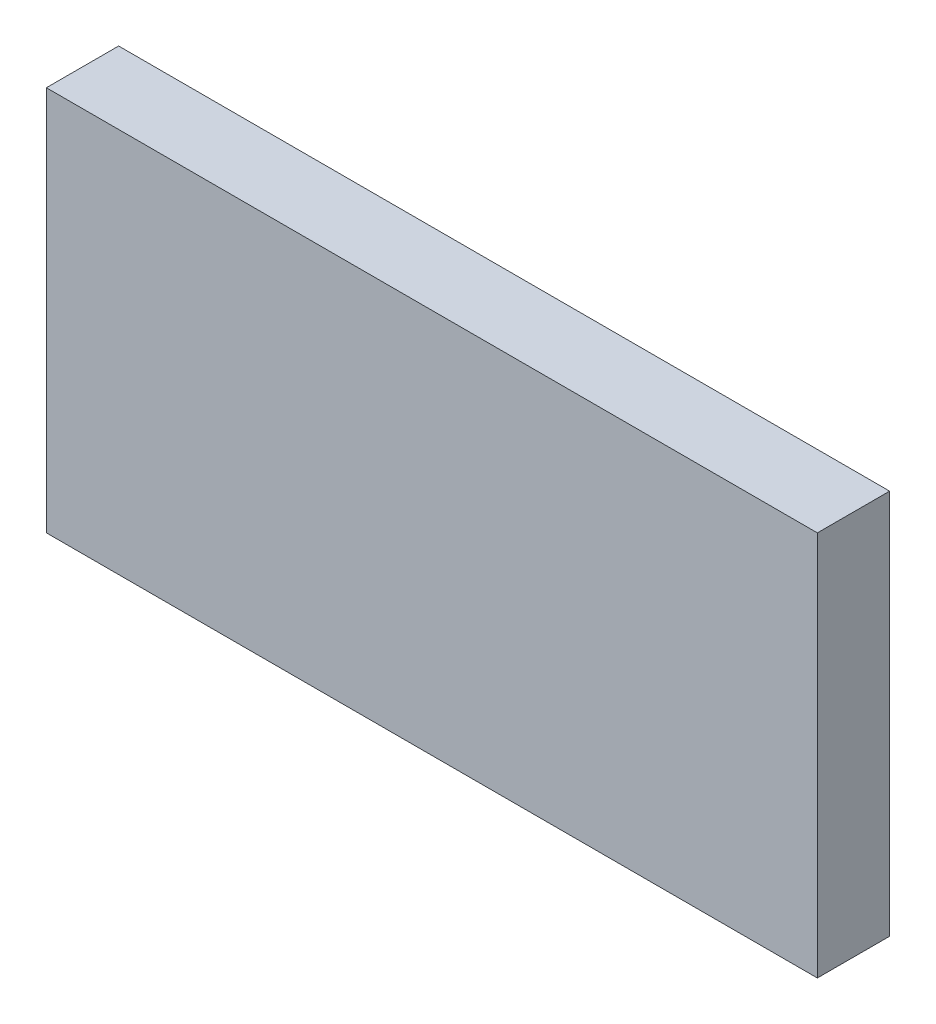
from build123d import *

# Parameters (mm, degrees)
SKETCH1_W      = 203.2
SKETCH1_H      = 19.05
EXTRUDE1_DEPTH = 101.6


with BuildPart() as part:
    # Sketch1 → Extrude1 (new body)
    with BuildSketch(Plane(origin=(0, 0, 0), x_dir=(1, 0, 0), z_dir=(0, 1, 0))):
        with Locations((101.6, 9.525)):
            Rectangle(SKETCH1_W, SKETCH1_H)
    extrude(amount=-EXTRUDE1_DEPTH)


solid = part.part
